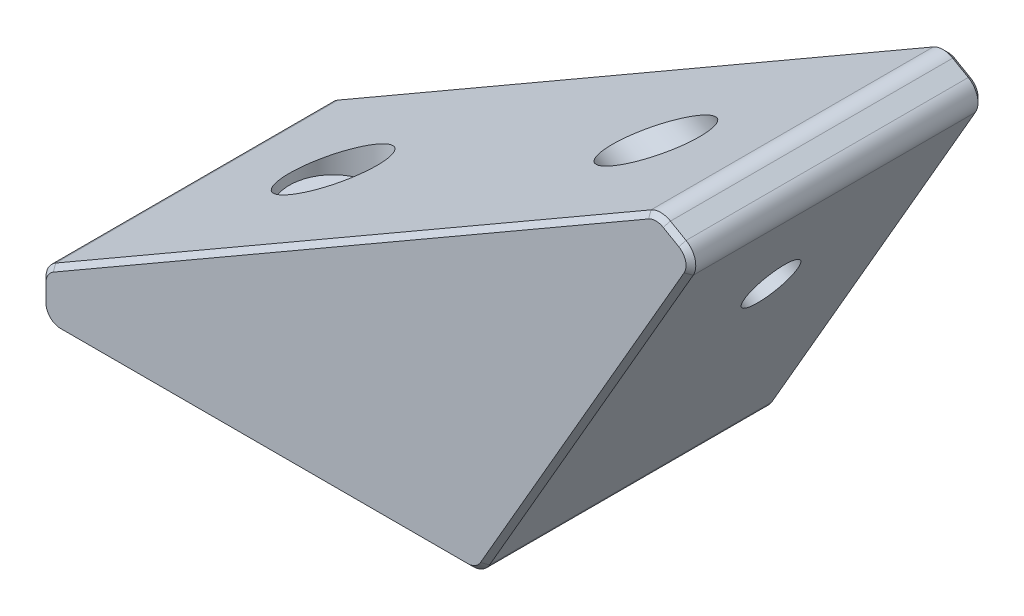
from build123d import *

# Parameters (mm, degrees)
DODANIE_WYCI_GNI_CIE1_DEPTH = 30
OTW_R_POD_RUB_M51_D         = 5.5
OTW_R_POD_RUB_M52_D         = 5.5
WYTNIJ_WYCI_GNI_CIE1_START  = -10
SZKIC9_R                    = 4.5
WYTNIJ_WYCI_GNI_CIE1_DEPTH  = 30
WYTNIJ_WYCI_GNI_CIE2_START  = -10
SZKIC10_R                   = 4.5
WYTNIJ_WYCI_GNI_CIE2_DEPTH  = 30
ZAOKR_GLENIE1_R             = 2
SFAZOWANIE1_SIZE            = 0.5


with BuildPart() as part:
    # Szkic1 → Dodanie-wyci_gni_cie1 (new body)
    with BuildSketch(Plane.XY):
        Polygon((0, 0), (0, 5), (63.169872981, 41.47114317), (67.5, 38.97114317), (45, 0), align=None)
    extrude(amount=DODANIE_WYCI_GNI_CIE1_DEPTH)

    # Otw_r pod _rub_ M51 (through all)
    with Locations(Plane(origin=(33.75, -19.485571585, 0), x_dir=(0, 0, -1), z_dir=(0.8660254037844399, -0.4999999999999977, 0))):
        with Locations((-15, 52.5)):
            Hole(OTW_R_POD_RUB_M51_D / 2)

    # Otw_r pod _rub_ M52 (through all)
    with Locations(Plane(origin=(0, 0, 0), x_dir=(-1, 0, 0), z_dir=(0, -1, 0))):
        with Locations((-15, -15)):
            Hole(OTW_R_POD_RUB_M52_D / 2)

    # Szkic9 → Wytnij-wyci_gni_cie1 (cut)
    with BuildSketch(Plane(origin=(33.75, -19.485571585, 0), x_dir=(0, 0, -1), z_dir=(0.8660254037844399, -0.4999999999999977, 0)).offset(WYTNIJ_WYCI_GNI_CIE1_START)):
        with Locations(Location((-15, 52.5, 0), (0, 0, 90))):
            Circle(SZKIC9_R)
    extrude(amount=-WYTNIJ_WYCI_GNI_CIE1_DEPTH, mode=Mode.SUBTRACT)

    # Szkic10 → Wytnij-wyci_gni_cie2 (cut)
    with BuildSketch(Plane.XZ.offset(WYTNIJ_WYCI_GNI_CIE2_START)):
        with Locations((15, 15)):
            Circle(SZKIC10_R)
    extrude(amount=-WYTNIJ_WYCI_GNI_CIE2_DEPTH, mode=Mode.SUBTRACT)

    # Zaokr_glenie1
    zaokr_glenie1_edges = [part.edges().sort_by_distance(p)[0] for p in [
        (0, 0, 15),
        (0, 5, 15),
        (63.169872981, 41.47114317, 15),
        (67.5, 38.97114317, 15),
        (45, 0, 15),
    ]]
    fillet(zaokr_glenie1_edges, radius=ZAOKR_GLENIE1_R)

    # Sfazowanie1
    sfazowanie1_edges = [part.edges().sort_by_distance(p)[0] for p in [
        (56.038675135, 19.119546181, 0),
        (56.038675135, 19.119546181, 30),
        (22.922649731, 0, 0),
        (0, 2.922649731, 0),
        (31.584936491, 23.235571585, 0),
        (64.968911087, 40.432468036, 0),
        (66.699800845, 38.756730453, 0),
        (63.169872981, 41.161742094, 0),
        (0.267949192, 4.845299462, 0),
        (0.585786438, 0.585786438, 0),
        (44.845299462, 0.267949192, 0),
        (22.922649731, 0, 30),
        (64.968911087, 40.432468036, 30),
        (31.584936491, 23.235571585, 30),
        (0, 2.922649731, 30),
        (66.699800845, 38.756730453, 30),
        (63.169872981, 41.161742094, 30),
        (0.267949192, 4.845299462, 30),
        (0.585786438, 0.585786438, 30),
        (44.845299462, 0.267949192, 30),
    ]]
    chamfer(sfazowanie1_edges, length=SFAZOWANIE1_SIZE)


solid = part.part
